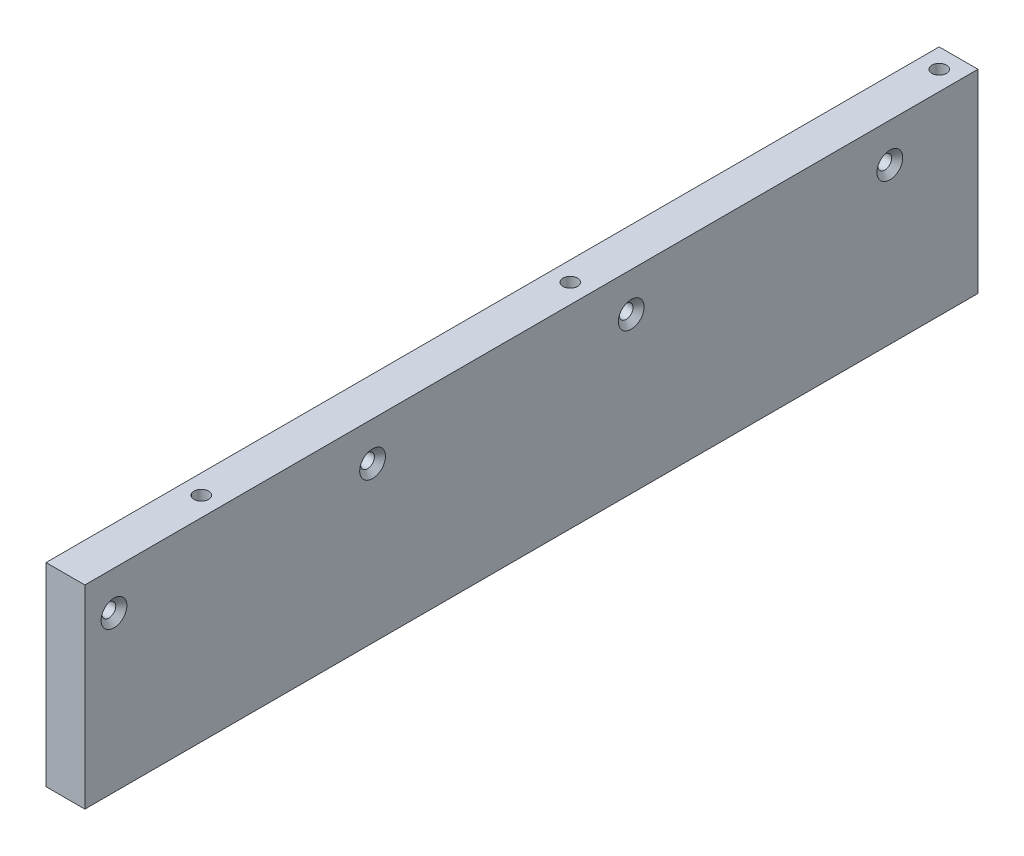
from build123d import *

# Parameters (mm, degrees)
SKETCH3_W                                         = 12.7
SKETCH3_H                                         = 292.1
EXTRUDE3_DEPTH                                    = 63.5
F_4_CLEARANCE_HOLE1_D                             = 3.2639
F_4_CLEARANCE_HOLE1_DEPTH                         = 82.55
F_4_CLEARANCE_HOLE1_TIP                           = 0.980574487
CSK_FOR_8_FLAT_HEAD_MACHINE_SCREW_100_D           = 4.4958
CSK_FOR_8_FLAT_HEAD_MACHINE_SCREW_100_CSINK_D     = 8.4328
CSK_FOR_8_FLAT_HEAD_MACHINE_SCREW_100_CSINK_ANGLE = 100
SKETCH12_R                                        = 2.3749
CUT_EXTRUDE1_DEPTH                                = 50.8
LPATTERN1_COUNT                                   = 3
LPATTERN1_PITCH                                   = 120.65


with BuildPart() as part:
    # Sketch3 → Extrude3 (new body)
    with BuildSketch(Plane(origin=(0, 0, 0), x_dir=(-1, 0, 0), z_dir=(0, 1, 0))):
        with Locations((-61.9125, -12.7)):
            Rectangle(SKETCH3_W, SKETCH3_H)
    extrude(amount=EXTRUDE3_DEPTH)

    # 4 Clearance Hole1
    with Locations(Plane(origin=(61.9125, 0, 88.9), x_dir=(0, 0, -1), z_dir=(0, -1, 0))):
        with Locations((0, 0), (120.65, 0), (241.3, 0)):
            Hole(F_4_CLEARANCE_HOLE1_D / 2, depth=F_4_CLEARANCE_HOLE1_DEPTH)
            with Locations((0, 0, -(F_4_CLEARANCE_HOLE1_DEPTH + F_4_CLEARANCE_HOLE1_TIP / 2))):  # 118° drill point
                Cone(0, F_4_CLEARANCE_HOLE1_D / 2, F_4_CLEARANCE_HOLE1_TIP, mode=Mode.SUBTRACT)

    # CSK for _8 Flat Head Machine Screw _100 (through all)
    with Locations(Plane(origin=(68.2625, 50.8, 123.825), x_dir=(0, 0, 1), z_dir=(1, 0, 0))):
        with Locations((0, 0), (-169.164, 0), (-253.746, 0), (-84.582, 0)):
            CounterSinkHole(CSK_FOR_8_FLAT_HEAD_MACHINE_SCREW_100_D / 2, CSK_FOR_8_FLAT_HEAD_MACHINE_SCREW_100_CSINK_D / 2, counter_sink_angle=CSK_FOR_8_FLAT_HEAD_MACHINE_SCREW_100_CSINK_ANGLE)

    # Sketch12 → Cut-Extrude1 (cut)
    with BuildSketch(Plane(origin=(0, 63.5, 0), x_dir=(1, 0, 0), z_dir=(0, 1, 0))):
        with Locations(Location((61.9125, 152.4, 0), (0, 0, 270))):
            Circle(SKETCH12_R)
    cut_extrude1 = extrude(amount=-CUT_EXTRUDE1_DEPTH, mode=Mode.SUBTRACT)

    # LPattern1: Cut-Extrude1 ×3
    with Locations(*[(0, 0, i * LPATTERN1_PITCH) for i in range(1, LPATTERN1_COUNT)]):
        add(cut_extrude1, mode=Mode.SUBTRACT)


solid = part.part
